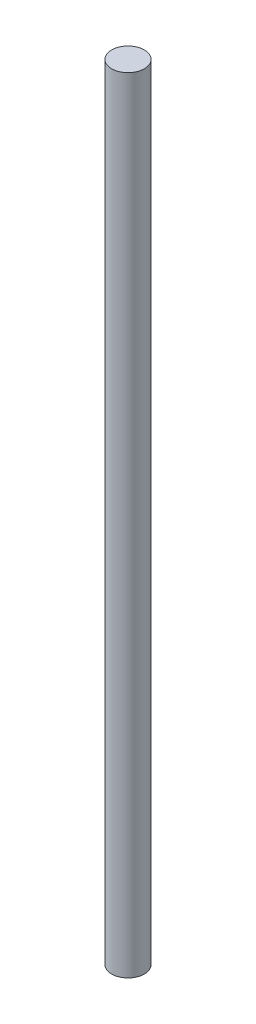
from build123d import *

# Parameters (mm, degrees)
SKETCH1_R           = 1.5875
BOSS_EXTRUDE1_DEPTH = 76.2


with BuildPart() as part:
    # Sketch1 → Boss-Extrude1 (new body)
    with BuildSketch(Plane(origin=(0, 0, 0), x_dir=(1, 0, 0), z_dir=(0, 1, 0))):
        with Locations(Location((0, 0, 0), (0, 0, 90))):
            Circle(SKETCH1_R)
    extrude(amount=BOSS_EXTRUDE1_DEPTH)


solid = part.part
